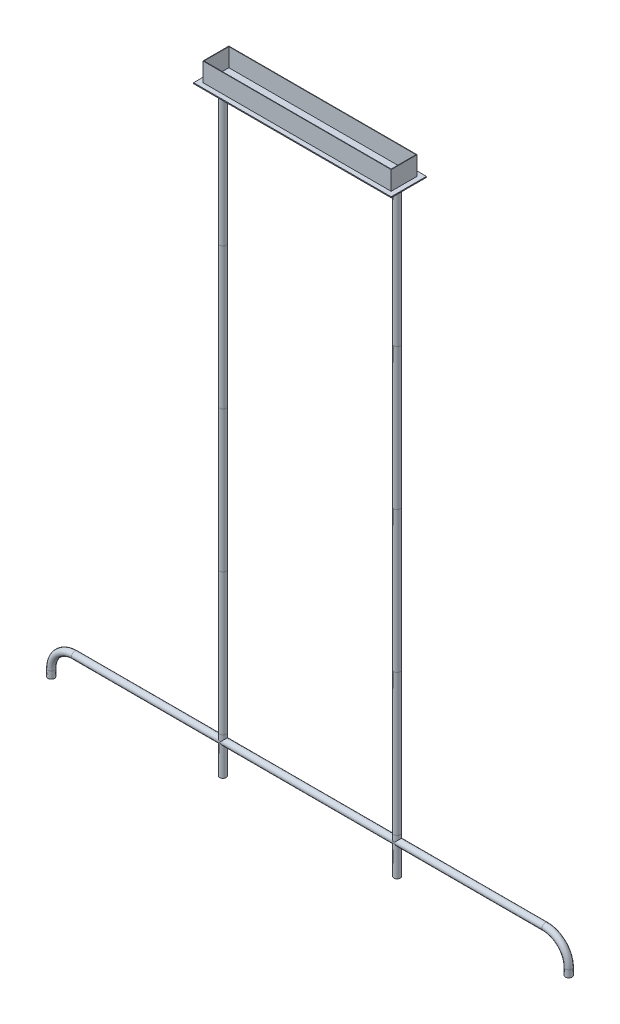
ISO-10303-21;
HEADER;
FILE_DESCRIPTION(('STEP AP214'),'2;1');
FILE_NAME('part.step','',(''),(''),'','','');
FILE_SCHEMA(('AUTOMOTIVE_DESIGN { 1 0 10303 214 1 1 1 1 }'));
ENDSEC;
DATA;
#1=APPLICATION_CONTEXT('core data for automotive mechanical design processes');
#2=APPLICATION_PROTOCOL_DEFINITION('international standard','automotive_design',2000,#1);
#3=PRODUCT_CONTEXT('',#1,'mechanical');
#4=PRODUCT('Part','Part','',(#3));
#5=PRODUCT_RELATED_PRODUCT_CATEGORY('part','',(#4));
#6=PRODUCT_DEFINITION_FORMATION('','',#4);
#7=PRODUCT_DEFINITION_CONTEXT('part definition',#1,'design');
#8=PRODUCT_DEFINITION('design','',#6,#7);
#9=PRODUCT_DEFINITION_SHAPE('','',#8);
#10=(LENGTH_UNIT() NAMED_UNIT(*) SI_UNIT(.MILLI.,.METRE.));
#11=(NAMED_UNIT(*) PLANE_ANGLE_UNIT() SI_UNIT($,.RADIAN.));
#12=(NAMED_UNIT(*) SI_UNIT($,.STERADIAN.) SOLID_ANGLE_UNIT());
#13=UNCERTAINTY_MEASURE_WITH_UNIT(LENGTH_MEASURE(1.E-05),#10,'distance_accuracy_value','');
#14=(GEOMETRIC_REPRESENTATION_CONTEXT(3) GLOBAL_UNCERTAINTY_ASSIGNED_CONTEXT((#13)) GLOBAL_UNIT_ASSIGNED_CONTEXT((#10,
#11,#12)) REPRESENTATION_CONTEXT('',''));
#15=CARTESIAN_POINT('',(0.,0.,0.));
#16=DIRECTION('',(0.,0.,1.));
#17=DIRECTION('',(1.,0.,0.));
#18=AXIS2_PLACEMENT_3D('',#15,#16,#17);
#19=CARTESIAN_POINT('',(-200.,1257.,27.5));
#20=DIRECTION('',(1.,0.,0.));
#21=DIRECTION('',(0.,0.,-1.));
#22=AXIS2_PLACEMENT_3D('',#19,#20,#21);
#23=PLANE('',#22);
#24=DIRECTION('',(0.,0.,1.));
#25=VECTOR('',#24,1.);
#26=CARTESIAN_POINT('',(-200.,1217.,27.5));
#27=LINE('',#26,#25);
#28=CARTESIAN_POINT('',(-200.,1217.,-27.5));
#29=VERTEX_POINT('',#28);
#30=CARTESIAN_POINT('',(-200.,1217.,27.5));
#31=VERTEX_POINT('',#30);
#32=EDGE_CURVE('E170',#29,#31,#27,.T.);
#33=ORIENTED_EDGE('',*,*,#32,.T.);
#34=DIRECTION('',(0.,-1.,0.));
#35=VECTOR('',#34,1.);
#36=CARTESIAN_POINT('',(-200.,1257.,27.5));
#37=LINE('',#36,#35);
#38=CARTESIAN_POINT('',(-200.,1257.,27.5));
#39=VERTEX_POINT('',#38);
#40=EDGE_CURVE('E13',#39,#31,#37,.T.);
#41=ORIENTED_EDGE('',*,*,#40,.F.);
#42=DIRECTION('',(0.,0.,1.));
#43=VECTOR('',#42,1.);
#44=CARTESIAN_POINT('',(-200.,1257.,27.5));
#45=LINE('',#44,#43);
#46=CARTESIAN_POINT('',(-200.,1257.,-27.5));
#47=VERTEX_POINT('',#46);
#48=EDGE_CURVE('E163',#47,#39,#45,.T.);
#49=ORIENTED_EDGE('',*,*,#48,.F.);
#50=DIRECTION('',(0.,-1.,0.));
#51=VECTOR('',#50,1.);
#52=CARTESIAN_POINT('',(-200.,1257.,-27.5));
#53=LINE('',#52,#51);
#54=EDGE_CURVE('E169',#47,#29,#53,.T.);
#55=ORIENTED_EDGE('',*,*,#54,.T.);
#56=EDGE_LOOP('',(#33,#41,#49,#55));
#57=FACE_BOUND('',#56,.T.);
#58=ADVANCED_FACE('F56',(#57),#23,.F.);
#59=CARTESIAN_POINT('',(200.,1257.,27.5));
#60=DIRECTION('',(0.,0.,-1.));
#61=DIRECTION('',(-1.,0.,0.));
#62=AXIS2_PLACEMENT_3D('',#59,#60,#61);
#63=PLANE('',#62);
#64=DIRECTION('',(1.,0.,0.));
#65=VECTOR('',#64,1.);
#66=CARTESIAN_POINT('',(200.,1217.,27.5));
#67=LINE('',#66,#65);
#68=CARTESIAN_POINT('',(200.,1217.,27.5));
#69=VERTEX_POINT('',#68);
#70=EDGE_CURVE('E173',#31,#69,#67,.T.);
#71=ORIENTED_EDGE('',*,*,#70,.T.);
#72=DIRECTION('',(0.,-1.,0.));
#73=VECTOR('',#72,1.);
#74=CARTESIAN_POINT('',(200.,1257.,27.5));
#75=LINE('',#74,#73);
#76=CARTESIAN_POINT('',(200.,1257.,27.5));
#77=VERTEX_POINT('',#76);
#78=EDGE_CURVE('E63',#77,#69,#75,.T.);
#79=ORIENTED_EDGE('',*,*,#78,.F.);
#80=DIRECTION('',(1.,0.,0.));
#81=VECTOR('',#80,1.);
#82=CARTESIAN_POINT('',(200.,1257.,27.5));
#83=LINE('',#82,#81);
#84=EDGE_CURVE('E107',#39,#77,#83,.T.);
#85=ORIENTED_EDGE('',*,*,#84,.F.);
#86=ORIENTED_EDGE('',*,*,#40,.T.);
#87=EDGE_LOOP('',(#71,#79,#85,#86));
#88=FACE_BOUND('',#87,.T.);
#89=ADVANCED_FACE('F202',(#88),#63,.F.);
#90=CARTESIAN_POINT('',(200.,1257.,27.5));
#91=DIRECTION('',(-1.,0.,0.));
#92=DIRECTION('',(0.,0.,1.));
#93=AXIS2_PLACEMENT_3D('',#90,#91,#92);
#94=PLANE('',#93);
#95=DIRECTION('',(0.,0.,-1.));
#96=VECTOR('',#95,1.);
#97=CARTESIAN_POINT('',(200.,1217.,27.5));
#98=LINE('',#97,#96);
#99=CARTESIAN_POINT('',(200.,1217.,-27.5));
#100=VERTEX_POINT('',#99);
#101=EDGE_CURVE('E175',#69,#100,#98,.T.);
#102=ORIENTED_EDGE('',*,*,#101,.T.);
#103=DIRECTION('',(0.,-1.,0.));
#104=VECTOR('',#103,1.);
#105=CARTESIAN_POINT('',(200.,1257.,-27.5));
#106=LINE('',#105,#104);
#107=CARTESIAN_POINT('',(200.,1257.,-27.5));
#108=VERTEX_POINT('',#107);
#109=EDGE_CURVE('E179',#108,#100,#106,.T.);
#110=ORIENTED_EDGE('',*,*,#109,.F.);
#111=DIRECTION('',(0.,0.,-1.));
#112=VECTOR('',#111,1.);
#113=CARTESIAN_POINT('',(200.,1257.,27.5));
#114=LINE('',#113,#112);
#115=EDGE_CURVE('E166',#77,#108,#114,.T.);
#116=ORIENTED_EDGE('',*,*,#115,.F.);
#117=ORIENTED_EDGE('',*,*,#78,.T.);
#118=EDGE_LOOP('',(#102,#110,#116,#117));
#119=FACE_BOUND('',#118,.T.);
#120=ADVANCED_FACE('F184',(#119),#94,.F.);
#121=CARTESIAN_POINT('',(200.,1257.,-27.5));
#122=DIRECTION('',(0.,0.,1.));
#123=DIRECTION('',(1.,0.,0.));
#124=AXIS2_PLACEMENT_3D('',#121,#122,#123);
#125=PLANE('',#124);
#126=DIRECTION('',(-1.,0.,0.));
#127=VECTOR('',#126,1.);
#128=CARTESIAN_POINT('',(200.,1217.,-27.5));
#129=LINE('',#128,#127);
#130=EDGE_CURVE('E100',#100,#29,#129,.T.);
#131=ORIENTED_EDGE('',*,*,#130,.T.);
#132=ORIENTED_EDGE('',*,*,#54,.F.);
#133=DIRECTION('',(-1.,0.,0.));
#134=VECTOR('',#133,1.);
#135=CARTESIAN_POINT('',(200.,1257.,-27.5));
#136=LINE('',#135,#134);
#137=EDGE_CURVE('E79',#108,#47,#136,.T.);
#138=ORIENTED_EDGE('',*,*,#137,.F.);
#139=ORIENTED_EDGE('',*,*,#109,.T.);
#140=EDGE_LOOP('',(#131,#132,#138,#139));
#141=FACE_BOUND('',#140,.T.);
#142=ADVANCED_FACE('F192',(#141),#125,.F.);
#143=CARTESIAN_POINT('',(0.,1257.,0.));
#144=DIRECTION('',(0.,1.,0.));
#145=DIRECTION('',(0.,0.,1.));
#146=AXIS2_PLACEMENT_3D('',#143,#144,#145);
#147=PLANE('',#146);
#148=DIRECTION('',(0.,0.,1.));
#149=VECTOR('',#148,1.);
#150=CARTESIAN_POINT('',(-199.,1257.,27.5));
#151=LINE('',#150,#149);
#152=CARTESIAN_POINT('',(-199.,1257.,-26.5));
#153=VERTEX_POINT('',#152);
#154=CARTESIAN_POINT('',(-199.,1257.,26.5));
#155=VERTEX_POINT('',#154);
#156=EDGE_CURVE('E152',#153,#155,#151,.T.);
#157=ORIENTED_EDGE('',*,*,#156,.F.);
#158=DIRECTION('',(-1.,0.,0.));
#159=VECTOR('',#158,1.);
#160=CARTESIAN_POINT('',(200.,1257.,-26.5));
#161=LINE('',#160,#159);
#162=CARTESIAN_POINT('',(199.,1257.,-26.5));
#163=VERTEX_POINT('',#162);
#164=EDGE_CURVE('E161',#163,#153,#161,.T.);
#165=ORIENTED_EDGE('',*,*,#164,.F.);
#166=DIRECTION('',(0.,0.,-1.));
#167=VECTOR('',#166,1.);
#168=CARTESIAN_POINT('',(199.,1257.,27.5));
#169=LINE('',#168,#167);
#170=CARTESIAN_POINT('',(199.,1257.,26.5));
#171=VERTEX_POINT('',#170);
#172=EDGE_CURVE('E159',#171,#163,#169,.T.);
#173=ORIENTED_EDGE('',*,*,#172,.F.);
#174=DIRECTION('',(1.,0.,0.));
#175=VECTOR('',#174,1.);
#176=CARTESIAN_POINT('',(200.,1257.,26.5));
#177=LINE('',#176,#175);
#178=EDGE_CURVE('E144',#155,#171,#177,.T.);
#179=ORIENTED_EDGE('',*,*,#178,.F.);
#180=EDGE_LOOP('',(#157,#165,#173,#179));
#181=FACE_BOUND('',#180,.T.);
#182=ORIENTED_EDGE('',*,*,#48,.T.);
#183=ORIENTED_EDGE('',*,*,#84,.T.);
#184=ORIENTED_EDGE('',*,*,#115,.T.);
#185=ORIENTED_EDGE('',*,*,#137,.T.);
#186=EDGE_LOOP('',(#182,#183,#184,#185));
#187=FACE_BOUND('',#186,.T.);
#188=ADVANCED_FACE('F194',(#181,#187),#147,.T.);
#189=CARTESIAN_POINT('',(0.,1217.,0.));
#190=DIRECTION('',(0.,1.,0.));
#191=DIRECTION('',(0.,0.,1.));
#192=AXIS2_PLACEMENT_3D('',#189,#190,#191);
#193=PLANE('',#192);
#194=ORIENTED_EDGE('',*,*,#32,.F.);
#195=ORIENTED_EDGE('',*,*,#130,.F.);
#196=ORIENTED_EDGE('',*,*,#101,.F.);
#197=ORIENTED_EDGE('',*,*,#70,.F.);
#198=EDGE_LOOP('',(#194,#195,#196,#197));
#199=FACE_BOUND('',#198,.T.);
#200=ADVANCED_FACE('F188',(#199),#193,.F.);
#201=CARTESIAN_POINT('',(-199.,1257.,27.5));
#202=DIRECTION('',(1.,0.,0.));
#203=DIRECTION('',(0.,0.,-1.));
#204=AXIS2_PLACEMENT_3D('',#201,#202,#203);
#205=PLANE('',#204);
#206=DIRECTION('',(0.,0.,1.));
#207=VECTOR('',#206,1.);
#208=CARTESIAN_POINT('',(-199.,1218.,27.5));
#209=LINE('',#208,#207);
#210=CARTESIAN_POINT('',(-199.,1218.,-26.5));
#211=VERTEX_POINT('',#210);
#212=CARTESIAN_POINT('',(-199.,1218.,26.5));
#213=VERTEX_POINT('',#212);
#214=EDGE_CURVE('E135',#211,#213,#209,.T.);
#215=ORIENTED_EDGE('',*,*,#214,.F.);
#216=DIRECTION('',(0.,-1.,0.));
#217=VECTOR('',#216,1.);
#218=CARTESIAN_POINT('',(-199.,1257.,-26.5));
#219=LINE('',#218,#217);
#220=EDGE_CURVE('E155',#153,#211,#219,.T.);
#221=ORIENTED_EDGE('',*,*,#220,.F.);
#222=ORIENTED_EDGE('',*,*,#156,.T.);
#223=DIRECTION('',(0.,-1.,0.));
#224=VECTOR('',#223,1.);
#225=CARTESIAN_POINT('',(-199.,1257.,26.5));
#226=LINE('',#225,#224);
#227=EDGE_CURVE('E147',#155,#213,#226,.T.);
#228=ORIENTED_EDGE('',*,*,#227,.T.);
#229=EDGE_LOOP('',(#215,#221,#222,#228));
#230=FACE_BOUND('',#229,.T.);
#231=ADVANCED_FACE('F229',(#230),#205,.T.);
#232=CARTESIAN_POINT('',(200.,1257.,26.5));
#233=DIRECTION('',(0.,0.,-1.));
#234=DIRECTION('',(-1.,0.,0.));
#235=AXIS2_PLACEMENT_3D('',#232,#233,#234);
#236=PLANE('',#235);
#237=DIRECTION('',(1.,0.,0.));
#238=VECTOR('',#237,1.);
#239=CARTESIAN_POINT('',(200.,1218.,26.5));
#240=LINE('',#239,#238);
#241=CARTESIAN_POINT('',(199.,1218.,26.5));
#242=VERTEX_POINT('',#241);
#243=EDGE_CURVE('E129',#213,#242,#240,.T.);
#244=ORIENTED_EDGE('',*,*,#243,.F.);
#245=ORIENTED_EDGE('',*,*,#227,.F.);
#246=ORIENTED_EDGE('',*,*,#178,.T.);
#247=DIRECTION('',(0.,-1.,0.));
#248=VECTOR('',#247,1.);
#249=CARTESIAN_POINT('',(199.,1257.,26.5));
#250=LINE('',#249,#248);
#251=EDGE_CURVE('E141',#171,#242,#250,.T.);
#252=ORIENTED_EDGE('',*,*,#251,.T.);
#253=EDGE_LOOP('',(#244,#245,#246,#252));
#254=FACE_BOUND('',#253,.T.);
#255=ADVANCED_FACE('F142',(#254),#236,.T.);
#256=CARTESIAN_POINT('',(199.,1257.,27.5));
#257=DIRECTION('',(-1.,0.,0.));
#258=DIRECTION('',(0.,0.,1.));
#259=AXIS2_PLACEMENT_3D('',#256,#257,#258);
#260=PLANE('',#259);
#261=DIRECTION('',(0.,0.,-1.));
#262=VECTOR('',#261,1.);
#263=CARTESIAN_POINT('',(199.,1218.,27.5));
#264=LINE('',#263,#262);
#265=CARTESIAN_POINT('',(199.,1218.,-26.5));
#266=VERTEX_POINT('',#265);
#267=EDGE_CURVE('E133',#242,#266,#264,.T.);
#268=ORIENTED_EDGE('',*,*,#267,.F.);
#269=ORIENTED_EDGE('',*,*,#251,.F.);
#270=ORIENTED_EDGE('',*,*,#172,.T.);
#271=DIRECTION('',(0.,-1.,0.));
#272=VECTOR('',#271,1.);
#273=CARTESIAN_POINT('',(199.,1257.,-26.5));
#274=LINE('',#273,#272);
#275=EDGE_CURVE('E70',#163,#266,#274,.T.);
#276=ORIENTED_EDGE('',*,*,#275,.T.);
#277=EDGE_LOOP('',(#268,#269,#270,#276));
#278=FACE_BOUND('',#277,.T.);
#279=ADVANCED_FACE('F149',(#278),#260,.T.);
#280=CARTESIAN_POINT('',(200.,1257.,-26.5));
#281=DIRECTION('',(0.,0.,1.));
#282=DIRECTION('',(1.,0.,0.));
#283=AXIS2_PLACEMENT_3D('',#280,#281,#282);
#284=PLANE('',#283);
#285=DIRECTION('',(-1.,0.,0.));
#286=VECTOR('',#285,1.);
#287=CARTESIAN_POINT('',(200.,1218.,-26.5));
#288=LINE('',#287,#286);
#289=EDGE_CURVE('E150',#266,#211,#288,.T.);
#290=ORIENTED_EDGE('',*,*,#289,.F.);
#291=ORIENTED_EDGE('',*,*,#275,.F.);
#292=ORIENTED_EDGE('',*,*,#164,.T.);
#293=ORIENTED_EDGE('',*,*,#220,.T.);
#294=EDGE_LOOP('',(#290,#291,#292,#293));
#295=FACE_BOUND('',#294,.T.);
#296=ADVANCED_FACE('F259',(#295),#284,.T.);
#297=CARTESIAN_POINT('',(0.,1218.,0.));
#298=DIRECTION('',(0.,1.,0.));
#299=DIRECTION('',(0.,0.,1.));
#300=AXIS2_PLACEMENT_3D('',#297,#298,#299);
#301=PLANE('',#300);
#302=ORIENTED_EDGE('',*,*,#214,.T.);
#303=ORIENTED_EDGE('',*,*,#243,.T.);
#304=ORIENTED_EDGE('',*,*,#267,.T.);
#305=ORIENTED_EDGE('',*,*,#289,.T.);
#306=EDGE_LOOP('',(#302,#303,#304,#305));
#307=FACE_BOUND('',#306,.T.);
#308=ADVANCED_FACE('F131',(#307),#301,.T.);
#309=CLOSED_SHELL('',(#58,#89,#120,#142,#188,#200,#231,#255,#279,#296,#308));
#310=MANIFOLD_SOLID_BREP('B2',#309);
#311=CARTESIAN_POINT('',(210.,1217.,-37.5));
#312=DIRECTION('',(-1.,0.,0.));
#313=DIRECTION('',(0.,0.,1.));
#314=AXIS2_PLACEMENT_3D('',#311,#312,#313);
#315=PLANE('',#314);
#316=DIRECTION('',(0.,0.,-1.));
#317=VECTOR('',#316,1.);
#318=CARTESIAN_POINT('',(210.,1215.,-37.5));
#319=LINE('',#318,#317);
#320=CARTESIAN_POINT('',(210.,1215.,37.5));
#321=VERTEX_POINT('',#320);
#322=CARTESIAN_POINT('',(210.,1215.,-37.5));
#323=VERTEX_POINT('',#322);
#324=EDGE_CURVE('E366',#321,#323,#319,.T.);
#325=ORIENTED_EDGE('',*,*,#324,.T.);
#326=DIRECTION('',(0.,-1.,0.));
#327=VECTOR('',#326,1.);
#328=CARTESIAN_POINT('',(210.,1217.,-37.5));
#329=LINE('',#328,#327);
#330=CARTESIAN_POINT('',(210.,1217.,-37.5));
#331=VERTEX_POINT('',#330);
#332=EDGE_CURVE('E54',#331,#323,#329,.T.);
#333=ORIENTED_EDGE('',*,*,#332,.F.);
#334=DIRECTION('',(0.,0.,-1.));
#335=VECTOR('',#334,1.);
#336=CARTESIAN_POINT('',(210.,1217.,-37.5));
#337=LINE('',#336,#335);
#338=CARTESIAN_POINT('',(210.,1217.,37.5));
#339=VERTEX_POINT('',#338);
#340=EDGE_CURVE('E354',#339,#331,#337,.T.);
#341=ORIENTED_EDGE('',*,*,#340,.F.);
#342=DIRECTION('',(0.,-1.,0.));
#343=VECTOR('',#342,1.);
#344=CARTESIAN_POINT('',(210.,1217.,37.5));
#345=LINE('',#344,#343);
#346=EDGE_CURVE('E362',#339,#321,#345,.T.);
#347=ORIENTED_EDGE('',*,*,#346,.T.);
#348=EDGE_LOOP('',(#325,#333,#341,#347));
#349=FACE_BOUND('',#348,.T.);
#350=ADVANCED_FACE('F303',(#349),#315,.F.);
#351=CARTESIAN_POINT('',(-210.,1217.,-37.5));
#352=DIRECTION('',(0.,0.,1.));
#353=DIRECTION('',(1.,0.,0.));
#354=AXIS2_PLACEMENT_3D('',#351,#352,#353);
#355=PLANE('',#354);
#356=DIRECTION('',(-1.,0.,0.));
#357=VECTOR('',#356,1.);
#358=CARTESIAN_POINT('',(-210.,1215.,-37.5));
#359=LINE('',#358,#357);
#360=CARTESIAN_POINT('',(-210.,1215.,-37.5));
#361=VERTEX_POINT('',#360);
#362=EDGE_CURVE('E358',#323,#361,#359,.T.);
#363=ORIENTED_EDGE('',*,*,#362,.T.);
#364=DIRECTION('',(0.,-1.,0.));
#365=VECTOR('',#364,1.);
#366=CARTESIAN_POINT('',(-210.,1217.,-37.5));
#367=LINE('',#366,#365);
#368=CARTESIAN_POINT('',(-210.,1217.,-37.5));
#369=VERTEX_POINT('',#368);
#370=EDGE_CURVE('E311',#369,#361,#367,.T.);
#371=ORIENTED_EDGE('',*,*,#370,.F.);
#372=DIRECTION('',(-1.,0.,0.));
#373=VECTOR('',#372,1.);
#374=CARTESIAN_POINT('',(-210.,1217.,-37.5));
#375=LINE('',#374,#373);
#376=EDGE_CURVE('E349',#331,#369,#375,.T.);
#377=ORIENTED_EDGE('',*,*,#376,.F.);
#378=ORIENTED_EDGE('',*,*,#332,.T.);
#379=EDGE_LOOP('',(#363,#371,#377,#378));
#380=FACE_BOUND('',#379,.T.);
#381=ADVANCED_FACE('F357',(#380),#355,.F.);
#382=CARTESIAN_POINT('',(-210.,1217.,-37.5));
#383=DIRECTION('',(1.,0.,0.));
#384=DIRECTION('',(0.,0.,-1.));
#385=AXIS2_PLACEMENT_3D('',#382,#383,#384);
#386=PLANE('',#385);
#387=DIRECTION('',(0.,0.,1.));
#388=VECTOR('',#387,1.);
#389=CARTESIAN_POINT('',(-210.,1215.,-37.5));
#390=LINE('',#389,#388);
#391=CARTESIAN_POINT('',(-210.,1215.,37.5));
#392=VERTEX_POINT('',#391);
#393=EDGE_CURVE('E336',#361,#392,#390,.T.);
#394=ORIENTED_EDGE('',*,*,#393,.T.);
#395=DIRECTION('',(0.,-1.,0.));
#396=VECTOR('',#395,1.);
#397=CARTESIAN_POINT('',(-210.,1217.,37.5));
#398=LINE('',#397,#396);
#399=CARTESIAN_POINT('',(-210.,1217.,37.5));
#400=VERTEX_POINT('',#399);
#401=EDGE_CURVE('E359',#400,#392,#398,.T.);
#402=ORIENTED_EDGE('',*,*,#401,.F.);
#403=DIRECTION('',(0.,0.,1.));
#404=VECTOR('',#403,1.);
#405=CARTESIAN_POINT('',(-210.,1217.,-37.5));
#406=LINE('',#405,#404);
#407=EDGE_CURVE('E352',#369,#400,#406,.T.);
#408=ORIENTED_EDGE('',*,*,#407,.F.);
#409=ORIENTED_EDGE('',*,*,#370,.T.);
#410=EDGE_LOOP('',(#394,#402,#408,#409));
#411=FACE_BOUND('',#410,.T.);
#412=ADVANCED_FACE('F360',(#411),#386,.F.);
#413=CARTESIAN_POINT('',(-210.,1217.,37.5));
#414=DIRECTION('',(0.,0.,-1.));
#415=DIRECTION('',(-1.,0.,0.));
#416=AXIS2_PLACEMENT_3D('',#413,#414,#415);
#417=PLANE('',#416);
#418=DIRECTION('',(1.,0.,0.));
#419=VECTOR('',#418,1.);
#420=CARTESIAN_POINT('',(-210.,1215.,37.5));
#421=LINE('',#420,#419);
#422=EDGE_CURVE('E342',#392,#321,#421,.T.);
#423=ORIENTED_EDGE('',*,*,#422,.T.);
#424=ORIENTED_EDGE('',*,*,#346,.F.);
#425=DIRECTION('',(1.,0.,0.));
#426=VECTOR('',#425,1.);
#427=CARTESIAN_POINT('',(-210.,1217.,37.5));
#428=LINE('',#427,#426);
#429=EDGE_CURVE('E319',#400,#339,#428,.T.);
#430=ORIENTED_EDGE('',*,*,#429,.F.);
#431=ORIENTED_EDGE('',*,*,#401,.T.);
#432=EDGE_LOOP('',(#423,#424,#430,#431));
#433=FACE_BOUND('',#432,.T.);
#434=ADVANCED_FACE('F373',(#433),#417,.F.);
#435=CARTESIAN_POINT('',(0.,1217.,0.));
#436=DIRECTION('',(0.,1.,0.));
#437=DIRECTION('',(0.,0.,1.));
#438=AXIS2_PLACEMENT_3D('',#435,#436,#437);
#439=PLANE('',#438);
#440=ORIENTED_EDGE('',*,*,#340,.T.);
#441=ORIENTED_EDGE('',*,*,#376,.T.);
#442=ORIENTED_EDGE('',*,*,#407,.T.);
#443=ORIENTED_EDGE('',*,*,#429,.T.);
#444=EDGE_LOOP('',(#440,#441,#442,#443));
#445=FACE_BOUND('',#444,.T.);
#446=ADVANCED_FACE('F350',(#445),#439,.T.);
#447=CARTESIAN_POINT('',(0.,1215.,0.));
#448=DIRECTION('',(0.,1.,0.));
#449=DIRECTION('',(0.,0.,1.));
#450=AXIS2_PLACEMENT_3D('',#447,#448,#449);
#451=PLANE('',#450);
#452=ORIENTED_EDGE('',*,*,#324,.F.);
#453=ORIENTED_EDGE('',*,*,#422,.F.);
#454=ORIENTED_EDGE('',*,*,#393,.F.);
#455=ORIENTED_EDGE('',*,*,#362,.F.);
#456=EDGE_LOOP('',(#452,#453,#454,#455));
#457=FACE_BOUND('',#456,.T.);
#458=ADVANCED_FACE('F376',(#457),#451,.F.);
#459=CLOSED_SHELL('',(#350,#381,#412,#434,#446,#458));
#460=MANIFOLD_SOLID_BREP('B7',#459);
#461=CARTESIAN_POINT('',(-185.,1215.,0.));
#462=DIRECTION('',(0.,-1.,0.));
#463=DIRECTION('',(0.,0.,-1.));
#464=AXIS2_PLACEMENT_3D('',#461,#462,#463);
#465=CYLINDRICAL_SURFACE('',#464,7.00000000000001);
#466=CARTESIAN_POINT('',(-185.,1215.,0.));
#467=DIRECTION('',(0.,1.,0.));
#468=DIRECTION('',(0.,0.,1.));
#469=AXIS2_PLACEMENT_3D('',#466,#467,#468);
#470=CIRCLE('',#469,7.00000000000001);
#471=CARTESIAN_POINT('',(-185.,1215.,7.00000000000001));
#472=VERTEX_POINT('',#471);
#473=EDGE_CURVE('E302',#472,#472,#470,.T.);
#474=ORIENTED_EDGE('',*,*,#473,.F.);
#475=EDGE_LOOP('',(#474));
#476=FACE_BOUND('',#475,.T.);
#477=CARTESIAN_POINT('',(-185.,915.,0.));
#478=DIRECTION('',(0.,1.,0.));
#479=DIRECTION('',(0.,0.,1.));
#480=AXIS2_PLACEMENT_3D('',#477,#478,#479);
#481=CIRCLE('',#480,7.00000000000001);
#482=CARTESIAN_POINT('',(-185.,915.,7.00000000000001));
#483=VERTEX_POINT('',#482);
#484=EDGE_CURVE('E437',#483,#483,#481,.T.);
#485=ORIENTED_EDGE('',*,*,#484,.T.);
#486=EDGE_LOOP('',(#485));
#487=FACE_BOUND('',#486,.T.);
#488=ADVANCED_FACE('F434',(#476,#487),#465,.T.);
#489=CARTESIAN_POINT('',(-185.,1215.,0.));
#490=DIRECTION('',(0.,1.,0.));
#491=DIRECTION('',(0.,0.,1.));
#492=AXIS2_PLACEMENT_3D('',#489,#490,#491);
#493=PLANE('',#492);
#494=ORIENTED_EDGE('',*,*,#473,.T.);
#495=EDGE_LOOP('',(#494));
#496=FACE_BOUND('',#495,.T.);
#497=ADVANCED_FACE('F449',(#496),#493,.T.);
#498=CARTESIAN_POINT('',(-185.,915.,0.));
#499=DIRECTION('',(0.,1.,0.));
#500=DIRECTION('',(0.,0.,1.));
#501=AXIS2_PLACEMENT_3D('',#498,#499,#500);
#502=PLANE('',#501);
#503=ORIENTED_EDGE('',*,*,#484,.F.);
#504=EDGE_LOOP('',(#503));
#505=FACE_BOUND('',#504,.T.);
#506=ADVANCED_FACE('F447',(#505),#502,.F.);
#507=CLOSED_SHELL('',(#488,#497,#506));
#508=MANIFOLD_SOLID_BREP('B48',#507);
#509=CARTESIAN_POINT('',(185.,1215.,0.));
#510=DIRECTION('',(0.,-1.,0.));
#511=DIRECTION('',(0.,0.,-1.));
#512=AXIS2_PLACEMENT_3D('',#509,#510,#511);
#513=CYLINDRICAL_SURFACE('',#512,7.00000000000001);
#514=CARTESIAN_POINT('',(185.,1215.,0.));
#515=DIRECTION('',(0.,1.,0.));
#516=DIRECTION('',(0.,0.,1.));
#517=AXIS2_PLACEMENT_3D('',#514,#515,#516);
#518=CIRCLE('',#517,7.00000000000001);
#519=CARTESIAN_POINT('',(185.,1215.,7.00000000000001));
#520=VERTEX_POINT('',#519);
#521=EDGE_CURVE('E433',#520,#520,#518,.T.);
#522=ORIENTED_EDGE('',*,*,#521,.F.);
#523=EDGE_LOOP('',(#522));
#524=FACE_BOUND('',#523,.T.);
#525=CARTESIAN_POINT('',(185.,915.,0.));
#526=DIRECTION('',(0.,1.,0.));
#527=DIRECTION('',(0.,0.,1.));
#528=AXIS2_PLACEMENT_3D('',#525,#526,#527);
#529=CIRCLE('',#528,7.00000000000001);
#530=CARTESIAN_POINT('',(185.,915.,7.00000000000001));
#531=VERTEX_POINT('',#530);
#532=EDGE_CURVE('E485',#531,#531,#529,.T.);
#533=ORIENTED_EDGE('',*,*,#532,.T.);
#534=EDGE_LOOP('',(#533));
#535=FACE_BOUND('',#534,.T.);
#536=ADVANCED_FACE('F482',(#524,#535),#513,.T.);
#537=CARTESIAN_POINT('',(185.,1215.,0.));
#538=DIRECTION('',(0.,1.,0.));
#539=DIRECTION('',(0.,0.,1.));
#540=AXIS2_PLACEMENT_3D('',#537,#538,#539);
#541=PLANE('',#540);
#542=ORIENTED_EDGE('',*,*,#521,.T.);
#543=EDGE_LOOP('',(#542));
#544=FACE_BOUND('',#543,.T.);
#545=ADVANCED_FACE('F497',(#544),#541,.T.);
#546=CARTESIAN_POINT('',(185.,915.,0.));
#547=DIRECTION('',(0.,1.,0.));
#548=DIRECTION('',(0.,0.,1.));
#549=AXIS2_PLACEMENT_3D('',#546,#547,#548);
#550=PLANE('',#549);
#551=ORIENTED_EDGE('',*,*,#532,.F.);
#552=EDGE_LOOP('',(#551));
#553=FACE_BOUND('',#552,.T.);
#554=ADVANCED_FACE('F495',(#553),#550,.F.);
#555=CLOSED_SHELL('',(#536,#545,#554));
#556=MANIFOLD_SOLID_BREP('B297',#555);
#557=CARTESIAN_POINT('',(-185.,915.,0.));
#558=DIRECTION('',(0.,-1.,0.));
#559=DIRECTION('',(0.,0.,-1.));
#560=AXIS2_PLACEMENT_3D('',#557,#558,#559);
#561=CYLINDRICAL_SURFACE('',#560,7.00000000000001);
#562=CARTESIAN_POINT('',(-185.,915.,0.));
#563=DIRECTION('',(0.,1.,0.));
#564=DIRECTION('',(0.,0.,1.));
#565=AXIS2_PLACEMENT_3D('',#562,#563,#564);
#566=CIRCLE('',#565,7.00000000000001);
#567=CARTESIAN_POINT('',(-185.,915.,7.00000000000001));
#568=VERTEX_POINT('',#567);
#569=EDGE_CURVE('E481',#568,#568,#566,.T.);
#570=ORIENTED_EDGE('',*,*,#569,.F.);
#571=EDGE_LOOP('',(#570));
#572=FACE_BOUND('',#571,.T.);
#573=CARTESIAN_POINT('',(-185.,615.,0.));
#574=DIRECTION('',(0.,1.,0.));
#575=DIRECTION('',(0.,0.,1.));
#576=AXIS2_PLACEMENT_3D('',#573,#574,#575);
#577=CIRCLE('',#576,7.00000000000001);
#578=CARTESIAN_POINT('',(-185.,615.,7.00000000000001));
#579=VERTEX_POINT('',#578);
#580=EDGE_CURVE('E533',#579,#579,#577,.T.);
#581=ORIENTED_EDGE('',*,*,#580,.T.);
#582=EDGE_LOOP('',(#581));
#583=FACE_BOUND('',#582,.T.);
#584=ADVANCED_FACE('F530',(#572,#583),#561,.T.);
#585=CARTESIAN_POINT('',(-185.,915.,0.));
#586=DIRECTION('',(0.,1.,0.));
#587=DIRECTION('',(0.,0.,1.));
#588=AXIS2_PLACEMENT_3D('',#585,#586,#587);
#589=PLANE('',#588);
#590=ORIENTED_EDGE('',*,*,#569,.T.);
#591=EDGE_LOOP('',(#590));
#592=FACE_BOUND('',#591,.T.);
#593=ADVANCED_FACE('F545',(#592),#589,.T.);
#594=CARTESIAN_POINT('',(-185.,615.,0.));
#595=DIRECTION('',(0.,1.,0.));
#596=DIRECTION('',(0.,0.,1.));
#597=AXIS2_PLACEMENT_3D('',#594,#595,#596);
#598=PLANE('',#597);
#599=ORIENTED_EDGE('',*,*,#580,.F.);
#600=EDGE_LOOP('',(#599));
#601=FACE_BOUND('',#600,.T.);
#602=ADVANCED_FACE('F543',(#601),#598,.F.);
#603=CLOSED_SHELL('',(#584,#593,#602));
#604=MANIFOLD_SOLID_BREP('B428',#603);
#605=CARTESIAN_POINT('',(185.,915.,0.));
#606=DIRECTION('',(0.,-1.,0.));
#607=DIRECTION('',(0.,0.,-1.));
#608=AXIS2_PLACEMENT_3D('',#605,#606,#607);
#609=CYLINDRICAL_SURFACE('',#608,7.00000000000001);
#610=CARTESIAN_POINT('',(185.,915.,0.));
#611=DIRECTION('',(0.,1.,0.));
#612=DIRECTION('',(0.,0.,1.));
#613=AXIS2_PLACEMENT_3D('',#610,#611,#612);
#614=CIRCLE('',#613,7.00000000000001);
#615=CARTESIAN_POINT('',(185.,915.,7.00000000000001));
#616=VERTEX_POINT('',#615);
#617=EDGE_CURVE('E529',#616,#616,#614,.T.);
#618=ORIENTED_EDGE('',*,*,#617,.F.);
#619=EDGE_LOOP('',(#618));
#620=FACE_BOUND('',#619,.T.);
#621=CARTESIAN_POINT('',(185.,615.,0.));
#622=DIRECTION('',(0.,1.,0.));
#623=DIRECTION('',(0.,0.,1.));
#624=AXIS2_PLACEMENT_3D('',#621,#622,#623);
#625=CIRCLE('',#624,7.00000000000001);
#626=CARTESIAN_POINT('',(185.,615.,7.00000000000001));
#627=VERTEX_POINT('',#626);
#628=EDGE_CURVE('E581',#627,#627,#625,.T.);
#629=ORIENTED_EDGE('',*,*,#628,.T.);
#630=EDGE_LOOP('',(#629));
#631=FACE_BOUND('',#630,.T.);
#632=ADVANCED_FACE('F578',(#620,#631),#609,.T.);
#633=CARTESIAN_POINT('',(185.,915.,0.));
#634=DIRECTION('',(0.,1.,0.));
#635=DIRECTION('',(0.,0.,1.));
#636=AXIS2_PLACEMENT_3D('',#633,#634,#635);
#637=PLANE('',#636);
#638=ORIENTED_EDGE('',*,*,#617,.T.);
#639=EDGE_LOOP('',(#638));
#640=FACE_BOUND('',#639,.T.);
#641=ADVANCED_FACE('F593',(#640),#637,.T.);
#642=CARTESIAN_POINT('',(185.,615.,0.));
#643=DIRECTION('',(0.,1.,0.));
#644=DIRECTION('',(0.,0.,1.));
#645=AXIS2_PLACEMENT_3D('',#642,#643,#644);
#646=PLANE('',#645);
#647=ORIENTED_EDGE('',*,*,#628,.F.);
#648=EDGE_LOOP('',(#647));
#649=FACE_BOUND('',#648,.T.);
#650=ADVANCED_FACE('F591',(#649),#646,.F.);
#651=CLOSED_SHELL('',(#632,#641,#650));
#652=MANIFOLD_SOLID_BREP('B476',#651);
#653=CARTESIAN_POINT('',(-185.,615.,0.));
#654=DIRECTION('',(0.,-1.,0.));
#655=DIRECTION('',(0.,0.,-1.));
#656=AXIS2_PLACEMENT_3D('',#653,#654,#655);
#657=CYLINDRICAL_SURFACE('',#656,7.00000000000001);
#658=CARTESIAN_POINT('',(-185.,615.,0.));
#659=DIRECTION('',(0.,1.,0.));
#660=DIRECTION('',(0.,0.,1.));
#661=AXIS2_PLACEMENT_3D('',#658,#659,#660);
#662=CIRCLE('',#661,7.00000000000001);
#663=CARTESIAN_POINT('',(-185.,615.,7.00000000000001));
#664=VERTEX_POINT('',#663);
#665=EDGE_CURVE('E577',#664,#664,#662,.T.);
#666=ORIENTED_EDGE('',*,*,#665,.F.);
#667=EDGE_LOOP('',(#666));
#668=FACE_BOUND('',#667,.T.);
#669=CARTESIAN_POINT('',(-185.,315.,0.));
#670=DIRECTION('',(0.,1.,0.));
#671=DIRECTION('',(0.,0.,1.));
#672=AXIS2_PLACEMENT_3D('',#669,#670,#671);
#673=CIRCLE('',#672,7.00000000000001);
#674=CARTESIAN_POINT('',(-185.,315.,7.00000000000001));
#675=VERTEX_POINT('',#674);
#676=EDGE_CURVE('E629',#675,#675,#673,.T.);
#677=ORIENTED_EDGE('',*,*,#676,.T.);
#678=EDGE_LOOP('',(#677));
#679=FACE_BOUND('',#678,.T.);
#680=ADVANCED_FACE('F626',(#668,#679),#657,.T.);
#681=CARTESIAN_POINT('',(-185.,615.,0.));
#682=DIRECTION('',(0.,1.,0.));
#683=DIRECTION('',(0.,0.,1.));
#684=AXIS2_PLACEMENT_3D('',#681,#682,#683);
#685=PLANE('',#684);
#686=ORIENTED_EDGE('',*,*,#665,.T.);
#687=EDGE_LOOP('',(#686));
#688=FACE_BOUND('',#687,.T.);
#689=ADVANCED_FACE('F641',(#688),#685,.T.);
#690=CARTESIAN_POINT('',(-185.,315.,0.));
#691=DIRECTION('',(0.,1.,0.));
#692=DIRECTION('',(0.,0.,1.));
#693=AXIS2_PLACEMENT_3D('',#690,#691,#692);
#694=PLANE('',#693);
#695=ORIENTED_EDGE('',*,*,#676,.F.);
#696=EDGE_LOOP('',(#695));
#697=FACE_BOUND('',#696,.T.);
#698=ADVANCED_FACE('F639',(#697),#694,.F.);
#699=CLOSED_SHELL('',(#680,#689,#698));
#700=MANIFOLD_SOLID_BREP('B524',#699);
#701=CARTESIAN_POINT('',(185.,615.,0.));
#702=DIRECTION('',(0.,-1.,0.));
#703=DIRECTION('',(0.,0.,-1.));
#704=AXIS2_PLACEMENT_3D('',#701,#702,#703);
#705=CYLINDRICAL_SURFACE('',#704,7.00000000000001);
#706=CARTESIAN_POINT('',(185.,615.,0.));
#707=DIRECTION('',(0.,1.,0.));
#708=DIRECTION('',(0.,0.,1.));
#709=AXIS2_PLACEMENT_3D('',#706,#707,#708);
#710=CIRCLE('',#709,7.00000000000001);
#711=CARTESIAN_POINT('',(185.,615.,7.00000000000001));
#712=VERTEX_POINT('',#711);
#713=EDGE_CURVE('E625',#712,#712,#710,.T.);
#714=ORIENTED_EDGE('',*,*,#713,.F.);
#715=EDGE_LOOP('',(#714));
#716=FACE_BOUND('',#715,.T.);
#717=CARTESIAN_POINT('',(185.,315.,0.));
#718=DIRECTION('',(0.,1.,0.));
#719=DIRECTION('',(0.,0.,1.));
#720=AXIS2_PLACEMENT_3D('',#717,#718,#719);
#721=CIRCLE('',#720,7.00000000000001);
#722=CARTESIAN_POINT('',(185.,315.,7.00000000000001));
#723=VERTEX_POINT('',#722);
#724=EDGE_CURVE('E677',#723,#723,#721,.T.);
#725=ORIENTED_EDGE('',*,*,#724,.T.);
#726=EDGE_LOOP('',(#725));
#727=FACE_BOUND('',#726,.T.);
#728=ADVANCED_FACE('F674',(#716,#727),#705,.T.);
#729=CARTESIAN_POINT('',(185.,615.,0.));
#730=DIRECTION('',(0.,1.,0.));
#731=DIRECTION('',(0.,0.,1.));
#732=AXIS2_PLACEMENT_3D('',#729,#730,#731);
#733=PLANE('',#732);
#734=ORIENTED_EDGE('',*,*,#713,.T.);
#735=EDGE_LOOP('',(#734));
#736=FACE_BOUND('',#735,.T.);
#737=ADVANCED_FACE('F689',(#736),#733,.T.);
#738=CARTESIAN_POINT('',(185.,315.,0.));
#739=DIRECTION('',(0.,1.,0.));
#740=DIRECTION('',(0.,0.,1.));
#741=AXIS2_PLACEMENT_3D('',#738,#739,#740);
#742=PLANE('',#741);
#743=ORIENTED_EDGE('',*,*,#724,.F.);
#744=EDGE_LOOP('',(#743));
#745=FACE_BOUND('',#744,.T.);
#746=ADVANCED_FACE('F687',(#745),#742,.F.);
#747=CLOSED_SHELL('',(#728,#737,#746));
#748=MANIFOLD_SOLID_BREP('B572',#747);
#749=CARTESIAN_POINT('',(-185.,315.,0.));
#750=DIRECTION('',(0.,-1.,0.));
#751=DIRECTION('',(0.,0.,-1.));
#752=AXIS2_PLACEMENT_3D('',#749,#750,#751);
#753=CYLINDRICAL_SURFACE('',#752,7.00000000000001);
#754=CARTESIAN_POINT('',(-185.,315.,0.));
#755=DIRECTION('',(0.,1.,0.));
#756=DIRECTION('',(0.,0.,1.));
#757=AXIS2_PLACEMENT_3D('',#754,#755,#756);
#758=CIRCLE('',#757,7.00000000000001);
#759=CARTESIAN_POINT('',(-185.,315.,7.00000000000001));
#760=VERTEX_POINT('',#759);
#761=EDGE_CURVE('E673',#760,#760,#758,.T.);
#762=ORIENTED_EDGE('',*,*,#761,.F.);
#763=EDGE_LOOP('',(#762));
#764=FACE_BOUND('',#763,.T.);
#765=CARTESIAN_POINT('',(-185.,15.,0.));
#766=DIRECTION('',(0.,1.,0.));
#767=DIRECTION('',(0.,0.,1.));
#768=AXIS2_PLACEMENT_3D('',#765,#766,#767);
#769=CIRCLE('',#768,7.00000000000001);
#770=CARTESIAN_POINT('',(-185.,15.,7.00000000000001));
#771=VERTEX_POINT('',#770);
#772=EDGE_CURVE('E725',#771,#771,#769,.T.);
#773=ORIENTED_EDGE('',*,*,#772,.T.);
#774=EDGE_LOOP('',(#773));
#775=FACE_BOUND('',#774,.T.);
#776=ADVANCED_FACE('F722',(#764,#775),#753,.T.);
#777=CARTESIAN_POINT('',(-185.,315.,0.));
#778=DIRECTION('',(0.,1.,0.));
#779=DIRECTION('',(0.,0.,1.));
#780=AXIS2_PLACEMENT_3D('',#777,#778,#779);
#781=PLANE('',#780);
#782=ORIENTED_EDGE('',*,*,#761,.T.);
#783=EDGE_LOOP('',(#782));
#784=FACE_BOUND('',#783,.T.);
#785=ADVANCED_FACE('F737',(#784),#781,.T.);
#786=CARTESIAN_POINT('',(-185.,15.,0.));
#787=DIRECTION('',(0.,1.,0.));
#788=DIRECTION('',(0.,0.,1.));
#789=AXIS2_PLACEMENT_3D('',#786,#787,#788);
#790=PLANE('',#789);
#791=ORIENTED_EDGE('',*,*,#772,.F.);
#792=EDGE_LOOP('',(#791));
#793=FACE_BOUND('',#792,.T.);
#794=ADVANCED_FACE('F735',(#793),#790,.F.);
#795=CLOSED_SHELL('',(#776,#785,#794));
#796=MANIFOLD_SOLID_BREP('B620',#795);
#797=CARTESIAN_POINT('',(185.,315.,0.));
#798=DIRECTION('',(0.,-1.,0.));
#799=DIRECTION('',(0.,0.,-1.));
#800=AXIS2_PLACEMENT_3D('',#797,#798,#799);
#801=CYLINDRICAL_SURFACE('',#800,7.00000000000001);
#802=CARTESIAN_POINT('',(185.,315.,0.));
#803=DIRECTION('',(0.,1.,0.));
#804=DIRECTION('',(0.,0.,1.));
#805=AXIS2_PLACEMENT_3D('',#802,#803,#804);
#806=CIRCLE('',#805,7.00000000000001);
#807=CARTESIAN_POINT('',(185.,315.,7.00000000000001));
#808=VERTEX_POINT('',#807);
#809=EDGE_CURVE('E721',#808,#808,#806,.T.);
#810=ORIENTED_EDGE('',*,*,#809,.F.);
#811=EDGE_LOOP('',(#810));
#812=FACE_BOUND('',#811,.T.);
#813=CARTESIAN_POINT('',(185.,15.,0.));
#814=DIRECTION('',(0.,1.,0.));
#815=DIRECTION('',(0.,0.,1.));
#816=AXIS2_PLACEMENT_3D('',#813,#814,#815);
#817=CIRCLE('',#816,7.00000000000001);
#818=CARTESIAN_POINT('',(185.,15.,7.00000000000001));
#819=VERTEX_POINT('',#818);
#820=EDGE_CURVE('E774',#819,#819,#817,.T.);
#821=ORIENTED_EDGE('',*,*,#820,.T.);
#822=EDGE_LOOP('',(#821));
#823=FACE_BOUND('',#822,.T.);
#824=ADVANCED_FACE('F771',(#812,#823),#801,.T.);
#825=CARTESIAN_POINT('',(185.,315.,0.));
#826=DIRECTION('',(0.,1.,0.));
#827=DIRECTION('',(0.,0.,1.));
#828=AXIS2_PLACEMENT_3D('',#825,#826,#827);
#829=PLANE('',#828);
#830=ORIENTED_EDGE('',*,*,#809,.T.);
#831=EDGE_LOOP('',(#830));
#832=FACE_BOUND('',#831,.T.);
#833=ADVANCED_FACE('F786',(#832),#829,.T.);
#834=CARTESIAN_POINT('',(185.,15.,0.));
#835=DIRECTION('',(0.,1.,0.));
#836=DIRECTION('',(0.,0.,1.));
#837=AXIS2_PLACEMENT_3D('',#834,#835,#836);
#838=PLANE('',#837);
#839=ORIENTED_EDGE('',*,*,#820,.F.);
#840=EDGE_LOOP('',(#839));
#841=FACE_BOUND('',#840,.T.);
#842=ADVANCED_FACE('F784',(#841),#838,.F.);
#843=CLOSED_SHELL('',(#824,#833,#842));
#844=MANIFOLD_SOLID_BREP('B668',#843);
#845=CARTESIAN_POINT('',(-500.,0.,0.));
#846=DIRECTION('',(1.,0.,0.));
#847=DIRECTION('',(0.,0.,-1.));
#848=AXIS2_PLACEMENT_3D('',#845,#846,#847);
#849=CYLINDRICAL_SURFACE('',#848,7.);
#850=CARTESIAN_POINT('',(185.,0.,0.));
#851=DIRECTION('',(0.707106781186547,-0.707106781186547,0.));
#852=DIRECTION('',(0.707106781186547,0.707106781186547,0.));
#853=AXIS2_PLACEMENT_3D('',#850,#851,#852);
#854=ELLIPSE('',#853,9.89949493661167,7.);
#855=CARTESIAN_POINT('',(185.,0.,7.00000000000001));
#856=VERTEX_POINT('',#855);
#857=CARTESIAN_POINT('',(185.,0.,-7.));
#858=VERTEX_POINT('',#857);
#859=EDGE_CURVE('E870',#856,#858,#854,.T.);
#860=ORIENTED_EDGE('',*,*,#859,.F.);
#861=CARTESIAN_POINT('',(185.,0.,0.));
#862=DIRECTION('',(0.707106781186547,0.707106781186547,0.));
#863=DIRECTION('',(0.707106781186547,-0.707106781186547,0.));
#864=AXIS2_PLACEMENT_3D('',#861,#862,#863);
#865=ELLIPSE('',#864,9.89949493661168,7.00000000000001);
#866=EDGE_CURVE('E873',#856,#858,#865,.F.);
#867=ORIENTED_EDGE('',*,*,#866,.T.);
#868=EDGE_LOOP('',(#860,#867));
#869=FACE_BOUND('',#868,.T.);
#870=CARTESIAN_POINT('',(-185.,0.,0.));
#871=DIRECTION('',(0.707106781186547,0.707106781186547,0.));
#872=DIRECTION('',(0.707106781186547,-0.707106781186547,0.));
#873=AXIS2_PLACEMENT_3D('',#870,#871,#872);
#874=ELLIPSE('',#873,9.89949493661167,7.);
#875=CARTESIAN_POINT('',(-185.,0.,-7.));
#876=VERTEX_POINT('',#875);
#877=CARTESIAN_POINT('',(-185.,0.,7.00000000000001));
#878=VERTEX_POINT('',#877);
#879=EDGE_CURVE('E854',#876,#878,#874,.F.);
#880=ORIENTED_EDGE('',*,*,#879,.F.);
#881=CARTESIAN_POINT('',(-185.,0.,0.));
#882=DIRECTION('',(0.707106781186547,-0.707106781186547,0.));
#883=DIRECTION('',(0.707106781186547,0.707106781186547,0.));
#884=AXIS2_PLACEMENT_3D('',#881,#882,#883);
#885=ELLIPSE('',#884,9.89949493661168,7.00000000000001);
#886=EDGE_CURVE('E769',#876,#878,#885,.T.);
#887=ORIENTED_EDGE('',*,*,#886,.T.);
#888=EDGE_LOOP('',(#880,#887));
#889=FACE_BOUND('',#888,.T.);
#890=ADVANCED_FACE('F811',(#869,#889),#849,.T.);
#891=CARTESIAN_POINT('',(-500.,0.,0.));
#892=DIRECTION('',(1.,0.,0.));
#893=DIRECTION('',(0.,0.,-1.));
#894=AXIS2_PLACEMENT_3D('',#891,#892,#893);
#895=CIRCLE('',#894,7.);
#896=CARTESIAN_POINT('',(-500.,7.00000000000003,0.));
#897=VERTEX_POINT('',#896);
#898=EDGE_CURVE('E961',#897,#897,#895,.T.);
#899=ORIENTED_EDGE('',*,*,#898,.T.);
#900=EDGE_LOOP('',(#899));
#901=FACE_BOUND('',#900,.T.);
#902=CARTESIAN_POINT('',(-185.,0.,0.));
#903=DIRECTION('',(0.707106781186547,-0.707106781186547,0.));
#904=DIRECTION('',(0.707106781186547,0.707106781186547,0.));
#905=AXIS2_PLACEMENT_3D('',#902,#903,#904);
#906=ELLIPSE('',#905,9.89949493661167,7.);
#907=EDGE_CURVE('E856',#878,#876,#906,.T.);
#908=ORIENTED_EDGE('',*,*,#907,.F.);
#909=CARTESIAN_POINT('',(-185.,0.,0.));
#910=DIRECTION('',(0.707106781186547,0.707106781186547,0.));
#911=DIRECTION('',(0.707106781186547,-0.707106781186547,0.));
#912=AXIS2_PLACEMENT_3D('',#909,#910,#911);
#913=ELLIPSE('',#912,9.89949493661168,7.00000000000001);
#914=EDGE_CURVE('E819',#878,#876,#913,.F.);
#915=ORIENTED_EDGE('',*,*,#914,.T.);
#916=EDGE_LOOP('',(#908,#915));
#917=FACE_BOUND('',#916,.T.);
#918=ADVANCED_FACE('F857',(#901,#917),#849,.T.);
#919=CARTESIAN_POINT('',(500.,0.,0.));
#920=DIRECTION('',(1.,0.,0.));
#921=DIRECTION('',(0.,0.,-1.));
#922=AXIS2_PLACEMENT_3D('',#919,#920,#921);
#923=CIRCLE('',#922,7.);
#924=CARTESIAN_POINT('',(500.,7.00000000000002,0.));
#925=VERTEX_POINT('',#924);
#926=EDGE_CURVE('E964',#925,#925,#923,.T.);
#927=ORIENTED_EDGE('',*,*,#926,.F.);
#928=EDGE_LOOP('',(#927));
#929=FACE_BOUND('',#928,.T.);
#930=CARTESIAN_POINT('',(185.,0.,0.));
#931=DIRECTION('',(0.707106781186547,0.707106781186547,0.));
#932=DIRECTION('',(0.707106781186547,-0.707106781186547,0.));
#933=AXIS2_PLACEMENT_3D('',#930,#931,#932);
#934=ELLIPSE('',#933,9.89949493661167,7.);
#935=EDGE_CURVE('E859',#858,#856,#934,.F.);
#936=ORIENTED_EDGE('',*,*,#935,.F.);
#937=CARTESIAN_POINT('',(185.,0.,0.));
#938=DIRECTION('',(0.707106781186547,-0.707106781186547,0.));
#939=DIRECTION('',(0.707106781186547,0.707106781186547,0.));
#940=AXIS2_PLACEMENT_3D('',#937,#938,#939);
#941=ELLIPSE('',#940,9.89949493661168,7.00000000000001);
#942=EDGE_CURVE('E825',#858,#856,#941,.T.);
#943=ORIENTED_EDGE('',*,*,#942,.T.);
#944=EDGE_LOOP('',(#936,#943));
#945=FACE_BOUND('',#944,.T.);
#946=ADVANCED_FACE('F878',(#929,#945),#849,.T.);
#947=CARTESIAN_POINT('',(-550.,-65.,0.));
#948=DIRECTION('',(0.,1.,0.));
#949=DIRECTION('',(0.,0.,-1.));
#950=AXIS2_PLACEMENT_3D('',#947,#948,#949);
#951=PLANE('',#950);
#952=CARTESIAN_POINT('',(-550.,-65.,0.));
#953=DIRECTION('',(0.,1.,0.));
#954=DIRECTION('',(0.,0.,-1.));
#955=AXIS2_PLACEMENT_3D('',#952,#953,#954);
#956=CIRCLE('',#955,7.);
#957=CARTESIAN_POINT('',(-550.,-65.,-7.));
#958=VERTEX_POINT('',#957);
#959=EDGE_CURVE('E949',#958,#958,#956,.T.);
#960=ORIENTED_EDGE('',*,*,#959,.F.);
#961=EDGE_LOOP('',(#960));
#962=FACE_BOUND('',#961,.T.);
#963=ADVANCED_FACE('F813',(#962),#951,.F.);
#964=CARTESIAN_POINT('',(550.,-65.,0.));
#965=DIRECTION('',(0.,-1.,0.));
#966=DIRECTION('',(0.,0.,-1.));
#967=AXIS2_PLACEMENT_3D('',#964,#965,#966);
#968=PLANE('',#967);
#969=CARTESIAN_POINT('',(550.,-65.,0.));
#970=DIRECTION('',(0.,-1.,0.));
#971=DIRECTION('',(0.,0.,-1.));
#972=AXIS2_PLACEMENT_3D('',#969,#970,#971);
#973=CIRCLE('',#972,7.);
#974=CARTESIAN_POINT('',(550.,-65.,-7.));
#975=VERTEX_POINT('',#974);
#976=EDGE_CURVE('E862',#975,#975,#973,.T.);
#977=ORIENTED_EDGE('',*,*,#976,.T.);
#978=EDGE_LOOP('',(#977));
#979=FACE_BOUND('',#978,.T.);
#980=ADVANCED_FACE('F914',(#979),#968,.T.);
#981=CARTESIAN_POINT('',(-550.,-65.,0.));
#982=DIRECTION('',(0.,1.,0.));
#983=DIRECTION('',(0.,0.,1.));
#984=AXIS2_PLACEMENT_3D('',#981,#982,#983);
#985=CYLINDRICAL_SURFACE('',#984,7.);
#986=CARTESIAN_POINT('',(-550.,-50.,0.));
#987=DIRECTION('',(0.,1.,0.));
#988=DIRECTION('',(0.,0.,-1.));
#989=AXIS2_PLACEMENT_3D('',#986,#987,#988);
#990=CIRCLE('',#989,7.);
#991=CARTESIAN_POINT('',(-557.,-50.,0.));
#992=VERTEX_POINT('',#991);
#993=EDGE_CURVE('E953',#992,#992,#990,.T.);
#994=ORIENTED_EDGE('',*,*,#993,.F.);
#995=EDGE_LOOP('',(#994));
#996=FACE_BOUND('',#995,.T.);
#997=ORIENTED_EDGE('',*,*,#959,.T.);
#998=EDGE_LOOP('',(#997));
#999=FACE_BOUND('',#998,.T.);
#1000=ADVANCED_FACE('F929',(#996,#999),#985,.T.);
#1001=CARTESIAN_POINT('',(-500.,-50.,0.));
#1002=DIRECTION('',(0.,0.,-1.));
#1003=DIRECTION('',(-1.,0.,0.));
#1004=AXIS2_PLACEMENT_3D('',#1001,#1002,#1003);
#1005=TOROIDAL_SURFACE('',#1004,50.,7.);
#1006=CARTESIAN_POINT('',(-500.,-50.,0.));
#1007=DIRECTION('',(0.,0.,-1.));
#1008=DIRECTION('',(-1.,0.,0.));
#1009=AXIS2_PLACEMENT_3D('',#1006,#1007,#1008);
#1010=CIRCLE('',#1009,57.);
#1011=EDGE_CURVE('',#992,#897,#1010,.T.);
#1012=ORIENTED_EDGE('',*,*,#993,.T.);
#1013=ORIENTED_EDGE('',*,*,#898,.F.);
#1014=ORIENTED_EDGE('',*,*,#1011,.T.);
#1015=ORIENTED_EDGE('',*,*,#1011,.F.);
#1016=EDGE_LOOP('',(#1012,#1014,#1013,#1015));
#1017=FACE_BOUND('',#1016,.T.);
#1018=ADVANCED_FACE('F924',(#1017),#1005,.T.);
#1019=CARTESIAN_POINT('',(500.,-50.,0.));
#1020=DIRECTION('',(0.,0.,-1.));
#1021=DIRECTION('',(-1.,0.,0.));
#1022=AXIS2_PLACEMENT_3D('',#1019,#1020,#1021);
#1023=TOROIDAL_SURFACE('',#1022,50.,7.);
#1024=CARTESIAN_POINT('',(550.,-50.,0.));
#1025=DIRECTION('',(0.,-1.,0.));
#1026=DIRECTION('',(0.,0.,-1.));
#1027=AXIS2_PLACEMENT_3D('',#1024,#1025,#1026);
#1028=CIRCLE('',#1027,7.);
#1029=CARTESIAN_POINT('',(557.,-50.,0.));
#1030=VERTEX_POINT('',#1029);
#1031=EDGE_CURVE('E864',#1030,#1030,#1028,.T.);
#1032=CARTESIAN_POINT('',(500.,-50.,0.));
#1033=DIRECTION('',(0.,0.,-1.));
#1034=DIRECTION('',(-1.,0.,0.));
#1035=AXIS2_PLACEMENT_3D('',#1032,#1033,#1034);
#1036=CIRCLE('',#1035,57.);
#1037=EDGE_CURVE('',#925,#1030,#1036,.T.);
#1038=ORIENTED_EDGE('',*,*,#926,.T.);
#1039=ORIENTED_EDGE('',*,*,#1031,.F.);
#1040=ORIENTED_EDGE('',*,*,#1037,.T.);
#1041=ORIENTED_EDGE('',*,*,#1037,.F.);
#1042=EDGE_LOOP('',(#1038,#1040,#1039,#1041));
#1043=FACE_BOUND('',#1042,.T.);
#1044=ADVANCED_FACE('F918',(#1043),#1023,.T.);
#1045=CARTESIAN_POINT('',(550.,-50.,0.));
#1046=DIRECTION('',(0.,-1.,0.));
#1047=DIRECTION('',(0.,0.,-1.));
#1048=AXIS2_PLACEMENT_3D('',#1045,#1046,#1047);
#1049=CYLINDRICAL_SURFACE('',#1048,7.);
#1050=ORIENTED_EDGE('',*,*,#976,.F.);
#1051=EDGE_LOOP('',(#1050));
#1052=FACE_BOUND('',#1051,.T.);
#1053=ORIENTED_EDGE('',*,*,#1031,.T.);
#1054=EDGE_LOOP('',(#1053));
#1055=FACE_BOUND('',#1054,.T.);
#1056=ADVANCED_FACE('F898',(#1052,#1055),#1049,.T.);
#1057=CARTESIAN_POINT('',(-185.,-65.,0.));
#1058=DIRECTION('',(0.,-1.,0.));
#1059=DIRECTION('',(0.,0.,-1.));
#1060=AXIS2_PLACEMENT_3D('',#1057,#1058,#1059);
#1061=PLANE('',#1060);
#1062=CARTESIAN_POINT('',(-185.,-65.,0.));
#1063=DIRECTION('',(0.,-1.,0.));
#1064=DIRECTION('',(0.,0.,-1.));
#1065=AXIS2_PLACEMENT_3D('',#1062,#1063,#1064);
#1066=CIRCLE('',#1065,7.00000000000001);
#1067=CARTESIAN_POINT('',(-185.,-65.,-7.00000000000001));
#1068=VERTEX_POINT('',#1067);
#1069=EDGE_CURVE('E948',#1068,#1068,#1066,.T.);
#1070=ORIENTED_EDGE('',*,*,#1069,.T.);
#1071=EDGE_LOOP('',(#1070));
#1072=FACE_BOUND('',#1071,.T.);
#1073=ADVANCED_FACE('F887',(#1072),#1061,.T.);
#1074=CARTESIAN_POINT('',(-185.,0.,0.));
#1075=DIRECTION('',(0.,-1.,0.));
#1076=DIRECTION('',(0.,0.,-1.));
#1077=AXIS2_PLACEMENT_3D('',#1074,#1075,#1076);
#1078=CYLINDRICAL_SURFACE('',#1077,7.00000000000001);
#1079=ORIENTED_EDGE('',*,*,#1069,.F.);
#1080=EDGE_LOOP('',(#1079));
#1081=FACE_BOUND('',#1080,.T.);
#1082=ORIENTED_EDGE('',*,*,#879,.T.);
#1083=ORIENTED_EDGE('',*,*,#907,.T.);
#1084=EDGE_LOOP('',(#1082,#1083));
#1085=FACE_BOUND('',#1084,.T.);
#1086=ADVANCED_FACE('F861',(#1081,#1085),#1078,.T.);
#1087=CARTESIAN_POINT('',(185.,-65.,0.));
#1088=DIRECTION('',(0.,-1.,0.));
#1089=DIRECTION('',(0.,0.,-1.));
#1090=AXIS2_PLACEMENT_3D('',#1087,#1088,#1089);
#1091=PLANE('',#1090);
#1092=CARTESIAN_POINT('',(185.,-65.,0.));
#1093=DIRECTION('',(0.,1.,0.));
#1094=DIRECTION('',(0.,0.,-1.));
#1095=AXIS2_PLACEMENT_3D('',#1092,#1093,#1094);
#1096=CIRCLE('',#1095,7.00000000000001);
#1097=CARTESIAN_POINT('',(185.,-65.,-7.00000000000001));
#1098=VERTEX_POINT('',#1097);
#1099=EDGE_CURVE('E950',#1098,#1098,#1096,.F.);
#1100=ORIENTED_EDGE('',*,*,#1099,.T.);
#1101=EDGE_LOOP('',(#1100));
#1102=FACE_BOUND('',#1101,.T.);
#1103=ADVANCED_FACE('F884',(#1102),#1091,.T.);
#1104=CARTESIAN_POINT('',(185.,0.,0.));
#1105=DIRECTION('',(0.,-1.,0.));
#1106=DIRECTION('',(0.,0.,-1.));
#1107=AXIS2_PLACEMENT_3D('',#1104,#1105,#1106);
#1108=CYLINDRICAL_SURFACE('',#1107,7.00000000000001);
#1109=ORIENTED_EDGE('',*,*,#1099,.F.);
#1110=EDGE_LOOP('',(#1109));
#1111=FACE_BOUND('',#1110,.T.);
#1112=ORIENTED_EDGE('',*,*,#935,.T.);
#1113=ORIENTED_EDGE('',*,*,#859,.T.);
#1114=EDGE_LOOP('',(#1112,#1113));
#1115=FACE_BOUND('',#1114,.T.);
#1116=ADVANCED_FACE('F881',(#1111,#1115),#1108,.T.);
#1117=CARTESIAN_POINT('',(185.,15.,0.));
#1118=DIRECTION('',(0.,-1.,0.));
#1119=DIRECTION('',(0.,0.,-1.));
#1120=AXIS2_PLACEMENT_3D('',#1117,#1118,#1119);
#1121=CYLINDRICAL_SURFACE('',#1120,7.00000000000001);
#1122=ORIENTED_EDGE('',*,*,#942,.F.);
#1123=ORIENTED_EDGE('',*,*,#866,.F.);
#1124=EDGE_LOOP('',(#1122,#1123));
#1125=FACE_BOUND('',#1124,.T.);
#1126=CARTESIAN_POINT('',(185.,15.,0.));
#1127=DIRECTION('',(0.,1.,0.));
#1128=DIRECTION('',(0.,0.,1.));
#1129=AXIS2_PLACEMENT_3D('',#1126,#1127,#1128);
#1130=CIRCLE('',#1129,7.00000000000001);
#1131=CARTESIAN_POINT('',(185.,15.,7.00000000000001));
#1132=VERTEX_POINT('',#1131);
#1133=EDGE_CURVE('E955',#1132,#1132,#1130,.T.);
#1134=ORIENTED_EDGE('',*,*,#1133,.F.);
#1135=EDGE_LOOP('',(#1134));
#1136=FACE_BOUND('',#1135,.T.);
#1137=ADVANCED_FACE('F883',(#1125,#1136),#1121,.T.);
#1138=CARTESIAN_POINT('',(185.,15.,0.));
#1139=DIRECTION('',(0.,1.,0.));
#1140=DIRECTION('',(0.,0.,1.));
#1141=AXIS2_PLACEMENT_3D('',#1138,#1139,#1140);
#1142=PLANE('',#1141);
#1143=ORIENTED_EDGE('',*,*,#1133,.T.);
#1144=EDGE_LOOP('',(#1143));
#1145=FACE_BOUND('',#1144,.T.);
#1146=ADVANCED_FACE('F892',(#1145),#1142,.T.);
#1147=CARTESIAN_POINT('',(-185.,15.,0.));
#1148=DIRECTION('',(0.,-1.,0.));
#1149=DIRECTION('',(0.,0.,-1.));
#1150=AXIS2_PLACEMENT_3D('',#1147,#1148,#1149);
#1151=CYLINDRICAL_SURFACE('',#1150,7.00000000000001);
#1152=ORIENTED_EDGE('',*,*,#886,.F.);
#1153=ORIENTED_EDGE('',*,*,#914,.F.);
#1154=EDGE_LOOP('',(#1152,#1153));
#1155=FACE_BOUND('',#1154,.T.);
#1156=CARTESIAN_POINT('',(-185.,15.,0.));
#1157=DIRECTION('',(0.,1.,0.));
#1158=DIRECTION('',(0.,0.,1.));
#1159=AXIS2_PLACEMENT_3D('',#1156,#1157,#1158);
#1160=CIRCLE('',#1159,7.00000000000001);
#1161=CARTESIAN_POINT('',(-185.,15.,7.00000000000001));
#1162=VERTEX_POINT('',#1161);
#1163=EDGE_CURVE('E973',#1162,#1162,#1160,.T.);
#1164=ORIENTED_EDGE('',*,*,#1163,.F.);
#1165=EDGE_LOOP('',(#1164));
#1166=FACE_BOUND('',#1165,.T.);
#1167=ADVANCED_FACE('F847',(#1155,#1166),#1151,.T.);
#1168=CARTESIAN_POINT('',(-185.,15.,0.));
#1169=DIRECTION('',(0.,1.,0.));
#1170=DIRECTION('',(0.,0.,1.));
#1171=AXIS2_PLACEMENT_3D('',#1168,#1169,#1170);
#1172=PLANE('',#1171);
#1173=ORIENTED_EDGE('',*,*,#1163,.T.);
#1174=EDGE_LOOP('',(#1173));
#1175=FACE_BOUND('',#1174,.T.);
#1176=ADVANCED_FACE('F977',(#1175),#1172,.T.);
#1177=CLOSED_SHELL('',(#890,#918,#946,#963,#980,#1000,#1018,#1044,#1056,#1073,#1086,#1103,#1116,
#1137,#1146,#1167,#1176));
#1178=MANIFOLD_SOLID_BREP('B716',#1177);
#1179=ADVANCED_BREP_SHAPE_REPRESENTATION('',(#18,#310,#460,#508,#556,#604,#652,#700,#748,#796,
#844,#1178),#14);
#1180=SHAPE_DEFINITION_REPRESENTATION(#9,#1179);
ENDSEC;
END-ISO-10303-21;
